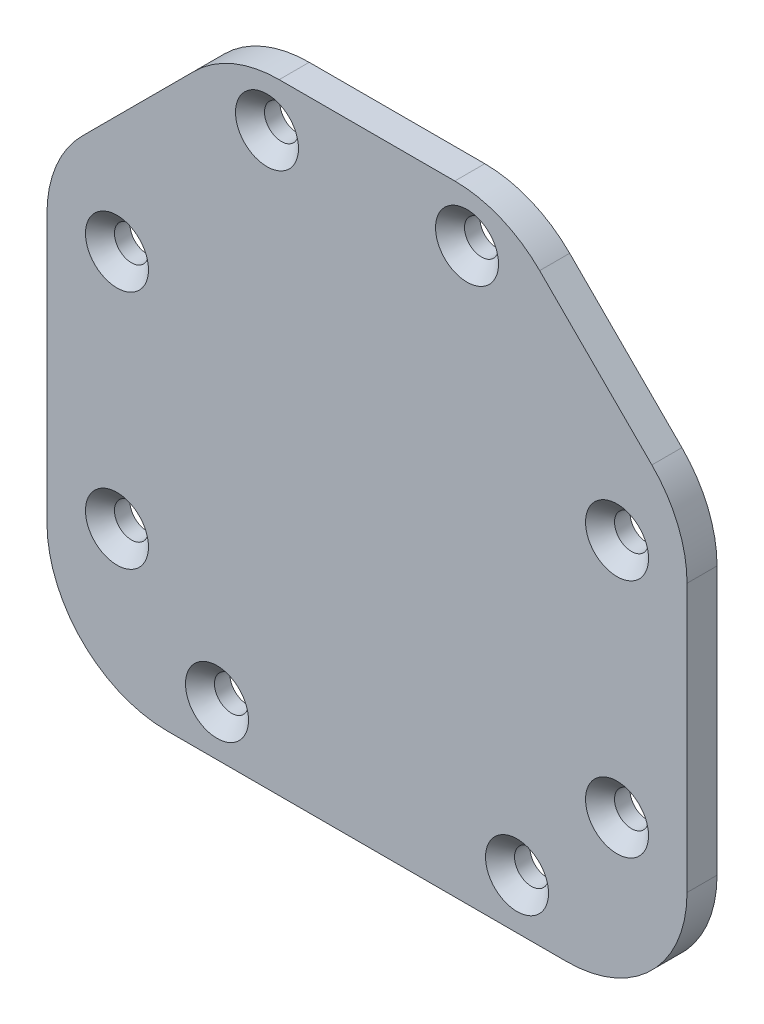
ISO-10303-21;
HEADER;
FILE_DESCRIPTION(('STEP AP214'),'2;1');
FILE_NAME('part.step','',(''),(''),'','','');
FILE_SCHEMA(('AUTOMOTIVE_DESIGN { 1 0 10303 214 1 1 1 1 }'));
ENDSEC;
DATA;
#1=APPLICATION_CONTEXT('core data for automotive mechanical design processes');
#2=APPLICATION_PROTOCOL_DEFINITION('international standard','automotive_design',2000,#1);
#3=PRODUCT_CONTEXT('',#1,'mechanical');
#4=PRODUCT('Part','Part','',(#3));
#5=PRODUCT_RELATED_PRODUCT_CATEGORY('part','',(#4));
#6=PRODUCT_DEFINITION_FORMATION('','',#4);
#7=PRODUCT_DEFINITION_CONTEXT('part definition',#1,'design');
#8=PRODUCT_DEFINITION('design','',#6,#7);
#9=PRODUCT_DEFINITION_SHAPE('','',#8);
#10=(LENGTH_UNIT() NAMED_UNIT(*) SI_UNIT(.MILLI.,.METRE.));
#11=(NAMED_UNIT(*) PLANE_ANGLE_UNIT() SI_UNIT($,.RADIAN.));
#12=(NAMED_UNIT(*) SI_UNIT($,.STERADIAN.) SOLID_ANGLE_UNIT());
#13=UNCERTAINTY_MEASURE_WITH_UNIT(LENGTH_MEASURE(1.E-05),#10,'distance_accuracy_value','');
#14=(GEOMETRIC_REPRESENTATION_CONTEXT(3) GLOBAL_UNCERTAINTY_ASSIGNED_CONTEXT((#13)) GLOBAL_UNIT_ASSIGNED_CONTEXT((#10,
#11,#12)) REPRESENTATION_CONTEXT('',''));
#15=CARTESIAN_POINT('',(0.,0.,0.));
#16=DIRECTION('',(0.,0.,1.));
#17=DIRECTION('',(1.,0.,0.));
#18=AXIS2_PLACEMENT_3D('',#15,#16,#17);
#19=CARTESIAN_POINT('',(20.,9.7794372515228,3.));
#20=DIRECTION('',(0.,0.,-1.));
#21=DIRECTION('',(-1.,0.,0.));
#22=AXIS2_PLACEMENT_3D('',#19,#20,#21);
#23=CYLINDRICAL_SURFACE('',#22,12.);
#24=CARTESIAN_POINT('',(20.,9.7794372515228,0.));
#25=DIRECTION('',(0.,0.,1.));
#26=DIRECTION('',(1.,0.,0.));
#27=AXIS2_PLACEMENT_3D('',#24,#25,#26);
#28=CIRCLE('',#27,12.);
#29=CARTESIAN_POINT('',(32.,9.77943725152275,0.));
#30=VERTEX_POINT('',#29);
#31=CARTESIAN_POINT('',(28.4852813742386,18.2647186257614,0.));
#32=VERTEX_POINT('',#31);
#33=EDGE_CURVE('E123',#30,#32,#28,.T.);
#34=ORIENTED_EDGE('',*,*,#33,.T.);
#35=DIRECTION('',(0.,0.,-1.));
#36=VECTOR('',#35,1.);
#37=CARTESIAN_POINT('',(28.4852813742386,18.2647186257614,3.));
#38=LINE('',#37,#36);
#39=CARTESIAN_POINT('',(28.4852813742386,18.2647186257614,3.));
#40=VERTEX_POINT('',#39);
#41=EDGE_CURVE('E11',#40,#32,#38,.T.);
#42=ORIENTED_EDGE('',*,*,#41,.F.);
#43=CARTESIAN_POINT('',(20.,9.7794372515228,3.));
#44=DIRECTION('',(0.,0.,1.));
#45=DIRECTION('',(1.,0.,0.));
#46=AXIS2_PLACEMENT_3D('',#43,#44,#45);
#47=CIRCLE('',#46,12.);
#48=CARTESIAN_POINT('',(32.,9.77943725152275,3.));
#49=VERTEX_POINT('',#48);
#50=EDGE_CURVE('E163',#49,#40,#47,.T.);
#51=ORIENTED_EDGE('',*,*,#50,.F.);
#52=DIRECTION('',(0.,0.,-1.));
#53=VECTOR('',#52,1.);
#54=CARTESIAN_POINT('',(32.,9.77943725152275,3.));
#55=LINE('',#54,#53);
#56=EDGE_CURVE('E136',#49,#30,#55,.T.);
#57=ORIENTED_EDGE('',*,*,#56,.T.);
#58=EDGE_LOOP('',(#34,#42,#51,#57));
#59=FACE_BOUND('',#58,.T.);
#60=ADVANCED_FACE('F31',(#59),#23,.T.);
#61=CARTESIAN_POINT('',(28.4852813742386,18.2647186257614,3.));
#62=DIRECTION('',(-0.707106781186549,-0.707106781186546,0.));
#63=DIRECTION('',(0.707106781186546,-0.707106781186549,0.));
#64=AXIS2_PLACEMENT_3D('',#61,#62,#63);
#65=PLANE('',#64);
#66=DIRECTION('',(-0.707106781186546,0.707106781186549,0.));
#67=VECTOR('',#66,1.);
#68=CARTESIAN_POINT('',(28.4852813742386,18.2647186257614,0.));
#69=LINE('',#68,#67);
#70=CARTESIAN_POINT('',(17.2647186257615,29.4852813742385,0.));
#71=VERTEX_POINT('',#70);
#72=EDGE_CURVE('E119',#32,#71,#69,.T.);
#73=ORIENTED_EDGE('',*,*,#72,.T.);
#74=DIRECTION('',(0.,0.,-1.));
#75=VECTOR('',#74,1.);
#76=CARTESIAN_POINT('',(17.2647186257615,29.4852813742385,3.));
#77=LINE('',#76,#75);
#78=CARTESIAN_POINT('',(17.2647186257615,29.4852813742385,3.));
#79=VERTEX_POINT('',#78);
#80=EDGE_CURVE('E38',#79,#71,#77,.T.);
#81=ORIENTED_EDGE('',*,*,#80,.F.);
#82=DIRECTION('',(-0.707106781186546,0.707106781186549,0.));
#83=VECTOR('',#82,1.);
#84=CARTESIAN_POINT('',(28.4852813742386,18.2647186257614,3.));
#85=LINE('',#84,#83);
#86=EDGE_CURVE('E132',#40,#79,#85,.T.);
#87=ORIENTED_EDGE('',*,*,#86,.F.);
#88=ORIENTED_EDGE('',*,*,#41,.T.);
#89=EDGE_LOOP('',(#73,#81,#87,#88));
#90=FACE_BOUND('',#89,.T.);
#91=ADVANCED_FACE('F131',(#90),#65,.F.);
#92=CARTESIAN_POINT('',(8.77943725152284,21.,3.));
#93=DIRECTION('',(0.,0.,-1.));
#94=DIRECTION('',(-1.,0.,0.));
#95=AXIS2_PLACEMENT_3D('',#92,#93,#94);
#96=CYLINDRICAL_SURFACE('',#95,12.);
#97=CARTESIAN_POINT('',(8.77943725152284,21.,0.));
#98=DIRECTION('',(0.,0.,1.));
#99=DIRECTION('',(1.,0.,0.));
#100=AXIS2_PLACEMENT_3D('',#97,#98,#99);
#101=CIRCLE('',#100,12.);
#102=CARTESIAN_POINT('',(8.7794372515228,33.,0.));
#103=VERTEX_POINT('',#102);
#104=EDGE_CURVE('E125',#71,#103,#101,.T.);
#105=ORIENTED_EDGE('',*,*,#104,.T.);
#106=DIRECTION('',(0.,0.,-1.));
#107=VECTOR('',#106,1.);
#108=CARTESIAN_POINT('',(8.7794372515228,33.,3.));
#109=LINE('',#108,#107);
#110=CARTESIAN_POINT('',(8.7794372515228,33.,3.));
#111=VERTEX_POINT('',#110);
#112=EDGE_CURVE('E209',#111,#103,#109,.T.);
#113=ORIENTED_EDGE('',*,*,#112,.F.);
#114=CARTESIAN_POINT('',(8.77943725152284,21.,3.));
#115=DIRECTION('',(0.,0.,1.));
#116=DIRECTION('',(1.,0.,0.));
#117=AXIS2_PLACEMENT_3D('',#114,#115,#116);
#118=CIRCLE('',#117,12.);
#119=EDGE_CURVE('E166',#79,#111,#118,.T.);
#120=ORIENTED_EDGE('',*,*,#119,.F.);
#121=ORIENTED_EDGE('',*,*,#80,.T.);
#122=EDGE_LOOP('',(#105,#113,#120,#121));
#123=FACE_BOUND('',#122,.T.);
#124=ADVANCED_FACE('F213',(#123),#96,.T.);
#125=CARTESIAN_POINT('',(8.7794372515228,33.,3.));
#126=DIRECTION('',(0.,-1.,0.));
#127=DIRECTION('',(0.,0.,-1.));
#128=AXIS2_PLACEMENT_3D('',#125,#126,#127);
#129=PLANE('',#128);
#130=DIRECTION('',(-1.,0.,0.));
#131=VECTOR('',#130,1.);
#132=CARTESIAN_POINT('',(8.7794372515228,33.,0.));
#133=LINE('',#132,#131);
#134=CARTESIAN_POINT('',(-8.7794372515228,33.,0.));
#135=VERTEX_POINT('',#134);
#136=EDGE_CURVE('E145',#103,#135,#133,.T.);
#137=ORIENTED_EDGE('',*,*,#136,.T.);
#138=DIRECTION('',(0.,0.,-1.));
#139=VECTOR('',#138,1.);
#140=CARTESIAN_POINT('',(-8.7794372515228,33.,3.));
#141=LINE('',#140,#139);
#142=CARTESIAN_POINT('',(-8.7794372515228,33.,3.));
#143=VERTEX_POINT('',#142);
#144=EDGE_CURVE('E206',#143,#135,#141,.T.);
#145=ORIENTED_EDGE('',*,*,#144,.F.);
#146=DIRECTION('',(-1.,0.,0.));
#147=VECTOR('',#146,1.);
#148=CARTESIAN_POINT('',(8.7794372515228,33.,3.));
#149=LINE('',#148,#147);
#150=EDGE_CURVE('E168',#111,#143,#149,.T.);
#151=ORIENTED_EDGE('',*,*,#150,.F.);
#152=ORIENTED_EDGE('',*,*,#112,.T.);
#153=EDGE_LOOP('',(#137,#145,#151,#152));
#154=FACE_BOUND('',#153,.T.);
#155=ADVANCED_FACE('F221',(#154),#129,.F.);
#156=CARTESIAN_POINT('',(-8.77943725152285,21.,3.));
#157=DIRECTION('',(0.,0.,-1.));
#158=DIRECTION('',(-1.,0.,0.));
#159=AXIS2_PLACEMENT_3D('',#156,#157,#158);
#160=CYLINDRICAL_SURFACE('',#159,12.);
#161=CARTESIAN_POINT('',(-8.77943725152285,21.,0.));
#162=DIRECTION('',(0.,0.,1.));
#163=DIRECTION('',(1.,0.,0.));
#164=AXIS2_PLACEMENT_3D('',#161,#162,#163);
#165=CIRCLE('',#164,12.);
#166=CARTESIAN_POINT('',(-17.2647186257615,29.4852813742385,0.));
#167=VERTEX_POINT('',#166);
#168=EDGE_CURVE('E147',#135,#167,#165,.T.);
#169=ORIENTED_EDGE('',*,*,#168,.T.);
#170=DIRECTION('',(0.,0.,-1.));
#171=VECTOR('',#170,1.);
#172=CARTESIAN_POINT('',(-17.2647186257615,29.4852813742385,3.));
#173=LINE('',#172,#171);
#174=CARTESIAN_POINT('',(-17.2647186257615,29.4852813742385,3.));
#175=VERTEX_POINT('',#174);
#176=EDGE_CURVE('E203',#175,#167,#173,.T.);
#177=ORIENTED_EDGE('',*,*,#176,.F.);
#178=CARTESIAN_POINT('',(-8.77943725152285,21.,3.));
#179=DIRECTION('',(0.,0.,1.));
#180=DIRECTION('',(1.,0.,0.));
#181=AXIS2_PLACEMENT_3D('',#178,#179,#180);
#182=CIRCLE('',#181,12.);
#183=EDGE_CURVE('E170',#143,#175,#182,.T.);
#184=ORIENTED_EDGE('',*,*,#183,.F.);
#185=ORIENTED_EDGE('',*,*,#144,.T.);
#186=EDGE_LOOP('',(#169,#177,#184,#185));
#187=FACE_BOUND('',#186,.T.);
#188=ADVANCED_FACE('F224',(#187),#160,.T.);
#189=CARTESIAN_POINT('',(-17.2647186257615,29.4852813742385,3.));
#190=DIRECTION('',(0.707106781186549,-0.707106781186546,0.));
#191=DIRECTION('',(0.707106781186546,0.707106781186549,0.));
#192=AXIS2_PLACEMENT_3D('',#189,#190,#191);
#193=PLANE('',#192);
#194=DIRECTION('',(-0.707106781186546,-0.707106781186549,0.));
#195=VECTOR('',#194,1.);
#196=CARTESIAN_POINT('',(-17.2647186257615,29.4852813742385,0.));
#197=LINE('',#196,#195);
#198=CARTESIAN_POINT('',(-28.4852813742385,18.2647186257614,0.));
#199=VERTEX_POINT('',#198);
#200=EDGE_CURVE('E149',#167,#199,#197,.T.);
#201=ORIENTED_EDGE('',*,*,#200,.T.);
#202=DIRECTION('',(0.,0.,-1.));
#203=VECTOR('',#202,1.);
#204=CARTESIAN_POINT('',(-28.4852813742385,18.2647186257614,3.));
#205=LINE('',#204,#203);
#206=CARTESIAN_POINT('',(-28.4852813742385,18.2647186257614,3.));
#207=VERTEX_POINT('',#206);
#208=EDGE_CURVE('E200',#207,#199,#205,.T.);
#209=ORIENTED_EDGE('',*,*,#208,.F.);
#210=DIRECTION('',(-0.707106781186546,-0.707106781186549,0.));
#211=VECTOR('',#210,1.);
#212=CARTESIAN_POINT('',(-17.2647186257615,29.4852813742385,3.));
#213=LINE('',#212,#211);
#214=EDGE_CURVE('E172',#175,#207,#213,.T.);
#215=ORIENTED_EDGE('',*,*,#214,.F.);
#216=ORIENTED_EDGE('',*,*,#176,.T.);
#217=EDGE_LOOP('',(#201,#209,#215,#216));
#218=FACE_BOUND('',#217,.T.);
#219=ADVANCED_FACE('F229',(#218),#193,.F.);
#220=CARTESIAN_POINT('',(-20.,9.77943725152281,3.));
#221=DIRECTION('',(0.,0.,-1.));
#222=DIRECTION('',(-1.,0.,0.));
#223=AXIS2_PLACEMENT_3D('',#220,#221,#222);
#224=CYLINDRICAL_SURFACE('',#223,12.);
#225=CARTESIAN_POINT('',(-20.,9.77943725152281,0.));
#226=DIRECTION('',(0.,0.,1.));
#227=DIRECTION('',(-1.,0.,0.));
#228=AXIS2_PLACEMENT_3D('',#225,#226,#227);
#229=CIRCLE('',#228,12.);
#230=CARTESIAN_POINT('',(-32.,9.77943725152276,0.));
#231=VERTEX_POINT('',#230);
#232=EDGE_CURVE('E151',#199,#231,#229,.T.);
#233=ORIENTED_EDGE('',*,*,#232,.T.);
#234=DIRECTION('',(0.,0.,-1.));
#235=VECTOR('',#234,1.);
#236=CARTESIAN_POINT('',(-32.,9.77943725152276,3.));
#237=LINE('',#236,#235);
#238=CARTESIAN_POINT('',(-32.,9.77943725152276,3.));
#239=VERTEX_POINT('',#238);
#240=EDGE_CURVE('E197',#239,#231,#237,.T.);
#241=ORIENTED_EDGE('',*,*,#240,.F.);
#242=CARTESIAN_POINT('',(-20.,9.77943725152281,3.));
#243=DIRECTION('',(0.,0.,1.));
#244=DIRECTION('',(-1.,0.,0.));
#245=AXIS2_PLACEMENT_3D('',#242,#243,#244);
#246=CIRCLE('',#245,12.);
#247=EDGE_CURVE('E174',#207,#239,#246,.T.);
#248=ORIENTED_EDGE('',*,*,#247,.F.);
#249=ORIENTED_EDGE('',*,*,#208,.T.);
#250=EDGE_LOOP('',(#233,#241,#248,#249));
#251=FACE_BOUND('',#250,.T.);
#252=ADVANCED_FACE('F235',(#251),#224,.T.);
#253=CARTESIAN_POINT('',(-32.,9.77943725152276,3.));
#254=DIRECTION('',(1.,0.,0.));
#255=DIRECTION('',(0.,1.,0.));
#256=AXIS2_PLACEMENT_3D('',#253,#254,#255);
#257=PLANE('',#256);
#258=DIRECTION('',(0.,-1.,0.));
#259=VECTOR('',#258,1.);
#260=CARTESIAN_POINT('',(-32.,9.77943725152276,0.));
#261=LINE('',#260,#259);
#262=CARTESIAN_POINT('',(-32.,-16.9999999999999,0.));
#263=VERTEX_POINT('',#262);
#264=EDGE_CURVE('E153',#231,#263,#261,.T.);
#265=ORIENTED_EDGE('',*,*,#264,.T.);
#266=DIRECTION('',(0.,0.,-1.));
#267=VECTOR('',#266,1.);
#268=CARTESIAN_POINT('',(-32.,-16.9999999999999,3.));
#269=LINE('',#268,#267);
#270=CARTESIAN_POINT('',(-32.,-16.9999999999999,3.));
#271=VERTEX_POINT('',#270);
#272=EDGE_CURVE('E194',#271,#263,#269,.T.);
#273=ORIENTED_EDGE('',*,*,#272,.F.);
#274=DIRECTION('',(0.,-1.,0.));
#275=VECTOR('',#274,1.);
#276=CARTESIAN_POINT('',(-32.,9.77943725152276,3.));
#277=LINE('',#276,#275);
#278=EDGE_CURVE('E176',#239,#271,#277,.T.);
#279=ORIENTED_EDGE('',*,*,#278,.F.);
#280=ORIENTED_EDGE('',*,*,#240,.T.);
#281=EDGE_LOOP('',(#265,#273,#279,#280));
#282=FACE_BOUND('',#281,.T.);
#283=ADVANCED_FACE('F239',(#282),#257,.F.);
#284=CARTESIAN_POINT('',(-20.,-17.,3.));
#285=DIRECTION('',(0.,0.,-1.));
#286=DIRECTION('',(-1.,0.,0.));
#287=AXIS2_PLACEMENT_3D('',#284,#285,#286);
#288=CYLINDRICAL_SURFACE('',#287,12.);
#289=CARTESIAN_POINT('',(-20.,-17.,0.));
#290=DIRECTION('',(0.,0.,1.));
#291=DIRECTION('',(1.,0.,0.));
#292=AXIS2_PLACEMENT_3D('',#289,#290,#291);
#293=CIRCLE('',#292,12.);
#294=CARTESIAN_POINT('',(-19.9999999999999,-29.,0.));
#295=VERTEX_POINT('',#294);
#296=EDGE_CURVE('E155',#263,#295,#293,.T.);
#297=ORIENTED_EDGE('',*,*,#296,.T.);
#298=DIRECTION('',(0.,0.,-1.));
#299=VECTOR('',#298,1.);
#300=CARTESIAN_POINT('',(-19.9999999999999,-29.,3.));
#301=LINE('',#300,#299);
#302=CARTESIAN_POINT('',(-19.9999999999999,-29.,3.));
#303=VERTEX_POINT('',#302);
#304=EDGE_CURVE('E191',#303,#295,#301,.T.);
#305=ORIENTED_EDGE('',*,*,#304,.F.);
#306=CARTESIAN_POINT('',(-20.,-17.,3.));
#307=DIRECTION('',(0.,0.,1.));
#308=DIRECTION('',(1.,0.,0.));
#309=AXIS2_PLACEMENT_3D('',#306,#307,#308);
#310=CIRCLE('',#309,12.);
#311=EDGE_CURVE('E178',#271,#303,#310,.T.);
#312=ORIENTED_EDGE('',*,*,#311,.F.);
#313=ORIENTED_EDGE('',*,*,#272,.T.);
#314=EDGE_LOOP('',(#297,#305,#312,#313));
#315=FACE_BOUND('',#314,.T.);
#316=ADVANCED_FACE('F244',(#315),#288,.T.);
#317=CARTESIAN_POINT('',(-19.9999999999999,-29.,3.));
#318=DIRECTION('',(0.,1.,0.));
#319=DIRECTION('',(0.,0.,1.));
#320=AXIS2_PLACEMENT_3D('',#317,#318,#319);
#321=PLANE('',#320);
#322=DIRECTION('',(1.,0.,0.));
#323=VECTOR('',#322,1.);
#324=CARTESIAN_POINT('',(-19.9999999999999,-29.,0.));
#325=LINE('',#324,#323);
#326=CARTESIAN_POINT('',(19.9999999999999,-29.,0.));
#327=VERTEX_POINT('',#326);
#328=EDGE_CURVE('E157',#295,#327,#325,.T.);
#329=ORIENTED_EDGE('',*,*,#328,.T.);
#330=DIRECTION('',(0.,0.,-1.));
#331=VECTOR('',#330,1.);
#332=CARTESIAN_POINT('',(19.9999999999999,-29.,3.));
#333=LINE('',#332,#331);
#334=CARTESIAN_POINT('',(19.9999999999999,-29.,3.));
#335=VERTEX_POINT('',#334);
#336=EDGE_CURVE('E188',#335,#327,#333,.T.);
#337=ORIENTED_EDGE('',*,*,#336,.F.);
#338=DIRECTION('',(1.,0.,0.));
#339=VECTOR('',#338,1.);
#340=CARTESIAN_POINT('',(-19.9999999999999,-29.,3.));
#341=LINE('',#340,#339);
#342=EDGE_CURVE('E180',#303,#335,#341,.T.);
#343=ORIENTED_EDGE('',*,*,#342,.F.);
#344=ORIENTED_EDGE('',*,*,#304,.T.);
#345=EDGE_LOOP('',(#329,#337,#343,#344));
#346=FACE_BOUND('',#345,.T.);
#347=ADVANCED_FACE('F248',(#346),#321,.F.);
#348=CARTESIAN_POINT('',(20.,-17.,3.));
#349=DIRECTION('',(0.,0.,-1.));
#350=DIRECTION('',(-1.,0.,0.));
#351=AXIS2_PLACEMENT_3D('',#348,#349,#350);
#352=CYLINDRICAL_SURFACE('',#351,12.);
#353=CARTESIAN_POINT('',(20.,-17.,0.));
#354=DIRECTION('',(0.,0.,1.));
#355=DIRECTION('',(1.,0.,0.));
#356=AXIS2_PLACEMENT_3D('',#353,#354,#355);
#357=CIRCLE('',#356,12.);
#358=CARTESIAN_POINT('',(32.,-16.9999999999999,0.));
#359=VERTEX_POINT('',#358);
#360=EDGE_CURVE('E159',#327,#359,#357,.T.);
#361=ORIENTED_EDGE('',*,*,#360,.T.);
#362=DIRECTION('',(0.,0.,-1.));
#363=VECTOR('',#362,1.);
#364=CARTESIAN_POINT('',(32.,-16.9999999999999,3.));
#365=LINE('',#364,#363);
#366=CARTESIAN_POINT('',(32.,-16.9999999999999,3.));
#367=VERTEX_POINT('',#366);
#368=EDGE_CURVE('E185',#367,#359,#365,.T.);
#369=ORIENTED_EDGE('',*,*,#368,.F.);
#370=CARTESIAN_POINT('',(20.,-17.,3.));
#371=DIRECTION('',(0.,0.,1.));
#372=DIRECTION('',(1.,0.,0.));
#373=AXIS2_PLACEMENT_3D('',#370,#371,#372);
#374=CIRCLE('',#373,12.);
#375=EDGE_CURVE('E50',#335,#367,#374,.T.);
#376=ORIENTED_EDGE('',*,*,#375,.F.);
#377=ORIENTED_EDGE('',*,*,#336,.T.);
#378=EDGE_LOOP('',(#361,#369,#376,#377));
#379=FACE_BOUND('',#378,.T.);
#380=ADVANCED_FACE('F252',(#379),#352,.T.);
#381=CARTESIAN_POINT('',(32.,-16.9999999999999,3.));
#382=DIRECTION('',(-1.,0.,0.));
#383=DIRECTION('',(0.,0.,1.));
#384=AXIS2_PLACEMENT_3D('',#381,#382,#383);
#385=PLANE('',#384);
#386=DIRECTION('',(0.,1.,0.));
#387=VECTOR('',#386,1.);
#388=CARTESIAN_POINT('',(32.,-16.9999999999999,0.));
#389=LINE('',#388,#387);
#390=EDGE_CURVE('E161',#359,#30,#389,.T.);
#391=ORIENTED_EDGE('',*,*,#390,.T.);
#392=ORIENTED_EDGE('',*,*,#56,.F.);
#393=DIRECTION('',(0.,1.,0.));
#394=VECTOR('',#393,1.);
#395=CARTESIAN_POINT('',(32.,-16.9999999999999,3.));
#396=LINE('',#395,#394);
#397=EDGE_CURVE('E45',#367,#49,#396,.T.);
#398=ORIENTED_EDGE('',*,*,#397,.F.);
#399=ORIENTED_EDGE('',*,*,#368,.T.);
#400=EDGE_LOOP('',(#391,#392,#398,#399));
#401=FACE_BOUND('',#400,.T.);
#402=ADVANCED_FACE('F254',(#401),#385,.F.);
#403=CARTESIAN_POINT('',(20.,9.7794372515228,3.));
#404=DIRECTION('',(0.,0.,1.));
#405=DIRECTION('',(1.,0.,0.));
#406=AXIS2_PLACEMENT_3D('',#403,#404,#405);
#407=PLANE('',#406);
#408=CARTESIAN_POINT('',(10.,28.,3.));
#409=DIRECTION('',(0.,0.,1.));
#410=DIRECTION('',(1.,0.,0.));
#411=AXIS2_PLACEMENT_3D('',#408,#409,#410);
#412=CIRCLE('',#411,3.15);
#413=CARTESIAN_POINT('',(13.15,28.,3.));
#414=VERTEX_POINT('',#413);
#415=EDGE_CURVE('E484',#414,#414,#412,.T.);
#416=ORIENTED_EDGE('',*,*,#415,.F.);
#417=EDGE_LOOP('',(#416));
#418=FACE_BOUND('',#417,.T.);
#419=CARTESIAN_POINT('',(-10.,28.,3.));
#420=DIRECTION('',(0.,0.,1.));
#421=DIRECTION('',(1.,0.,0.));
#422=AXIS2_PLACEMENT_3D('',#419,#420,#421);
#423=CIRCLE('',#422,3.15);
#424=CARTESIAN_POINT('',(-6.85,28.,3.));
#425=VERTEX_POINT('',#424);
#426=EDGE_CURVE('E496',#425,#425,#423,.T.);
#427=ORIENTED_EDGE('',*,*,#426,.F.);
#428=EDGE_LOOP('',(#427));
#429=FACE_BOUND('',#428,.T.);
#430=CARTESIAN_POINT('',(-25.,10.,3.));
#431=DIRECTION('',(0.,0.,1.));
#432=DIRECTION('',(1.,0.,0.));
#433=AXIS2_PLACEMENT_3D('',#430,#431,#432);
#434=CIRCLE('',#433,3.15);
#435=CARTESIAN_POINT('',(-21.85,10.,3.));
#436=VERTEX_POINT('',#435);
#437=EDGE_CURVE('E505',#436,#436,#434,.T.);
#438=ORIENTED_EDGE('',*,*,#437,.F.);
#439=EDGE_LOOP('',(#438));
#440=FACE_BOUND('',#439,.T.);
#441=CARTESIAN_POINT('',(-25.,-14.,3.));
#442=DIRECTION('',(0.,0.,1.));
#443=DIRECTION('',(1.,0.,0.));
#444=AXIS2_PLACEMENT_3D('',#441,#442,#443);
#445=CIRCLE('',#444,3.15);
#446=CARTESIAN_POINT('',(-21.85,-14.,3.));
#447=VERTEX_POINT('',#446);
#448=EDGE_CURVE('E514',#447,#447,#445,.T.);
#449=ORIENTED_EDGE('',*,*,#448,.F.);
#450=EDGE_LOOP('',(#449));
#451=FACE_BOUND('',#450,.T.);
#452=CARTESIAN_POINT('',(-15.,-24.,3.));
#453=DIRECTION('',(0.,0.,1.));
#454=DIRECTION('',(1.,0.,0.));
#455=AXIS2_PLACEMENT_3D('',#452,#453,#454);
#456=CIRCLE('',#455,3.15);
#457=CARTESIAN_POINT('',(-11.85,-24.,3.));
#458=VERTEX_POINT('',#457);
#459=EDGE_CURVE('E523',#458,#458,#456,.T.);
#460=ORIENTED_EDGE('',*,*,#459,.F.);
#461=EDGE_LOOP('',(#460));
#462=FACE_BOUND('',#461,.T.);
#463=CARTESIAN_POINT('',(15.,-24.,3.));
#464=DIRECTION('',(0.,0.,1.));
#465=DIRECTION('',(1.,0.,0.));
#466=AXIS2_PLACEMENT_3D('',#463,#464,#465);
#467=CIRCLE('',#466,3.15);
#468=CARTESIAN_POINT('',(18.15,-24.,3.));
#469=VERTEX_POINT('',#468);
#470=EDGE_CURVE('E532',#469,#469,#467,.T.);
#471=ORIENTED_EDGE('',*,*,#470,.F.);
#472=EDGE_LOOP('',(#471));
#473=FACE_BOUND('',#472,.T.);
#474=CARTESIAN_POINT('',(25.,-14.,3.));
#475=DIRECTION('',(0.,0.,1.));
#476=DIRECTION('',(1.,0.,0.));
#477=AXIS2_PLACEMENT_3D('',#474,#475,#476);
#478=CIRCLE('',#477,3.15);
#479=CARTESIAN_POINT('',(28.15,-14.,3.));
#480=VERTEX_POINT('',#479);
#481=EDGE_CURVE('E541',#480,#480,#478,.T.);
#482=ORIENTED_EDGE('',*,*,#481,.F.);
#483=EDGE_LOOP('',(#482));
#484=FACE_BOUND('',#483,.T.);
#485=CARTESIAN_POINT('',(25.,10.,3.));
#486=DIRECTION('',(0.,0.,1.));
#487=DIRECTION('',(1.,0.,0.));
#488=AXIS2_PLACEMENT_3D('',#485,#486,#487);
#489=CIRCLE('',#488,3.15);
#490=CARTESIAN_POINT('',(28.15,10.,3.));
#491=VERTEX_POINT('',#490);
#492=EDGE_CURVE('E137',#491,#491,#489,.T.);
#493=ORIENTED_EDGE('',*,*,#492,.F.);
#494=EDGE_LOOP('',(#493));
#495=FACE_BOUND('',#494,.T.);
#496=ORIENTED_EDGE('',*,*,#50,.T.);
#497=ORIENTED_EDGE('',*,*,#86,.T.);
#498=ORIENTED_EDGE('',*,*,#119,.T.);
#499=ORIENTED_EDGE('',*,*,#150,.T.);
#500=ORIENTED_EDGE('',*,*,#183,.T.);
#501=ORIENTED_EDGE('',*,*,#214,.T.);
#502=ORIENTED_EDGE('',*,*,#247,.T.);
#503=ORIENTED_EDGE('',*,*,#278,.T.);
#504=ORIENTED_EDGE('',*,*,#311,.T.);
#505=ORIENTED_EDGE('',*,*,#342,.T.);
#506=ORIENTED_EDGE('',*,*,#375,.T.);
#507=ORIENTED_EDGE('',*,*,#397,.T.);
#508=EDGE_LOOP('',(#496,#497,#498,#499,#500,#501,#502,#503,#504,#505,#506,#507));
#509=FACE_BOUND('',#508,.T.);
#510=ADVANCED_FACE('F216',(#418,#429,#440,#451,#462,#473,#484,#495,#509),#407,.T.);
#511=CARTESIAN_POINT('',(20.,9.7794372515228,0.));
#512=DIRECTION('',(0.,0.,1.));
#513=DIRECTION('',(1.,0.,0.));
#514=AXIS2_PLACEMENT_3D('',#511,#512,#513);
#515=PLANE('',#514);
#516=CARTESIAN_POINT('',(10.,28.,0.));
#517=DIRECTION('',(0.,0.,1.));
#518=DIRECTION('',(1.,0.,0.));
#519=AXIS2_PLACEMENT_3D('',#516,#517,#518);
#520=CIRCLE('',#519,1.7);
#521=CARTESIAN_POINT('',(11.7,28.,0.));
#522=VERTEX_POINT('',#521);
#523=EDGE_CURVE('E480',#522,#522,#520,.T.);
#524=ORIENTED_EDGE('',*,*,#523,.T.);
#525=EDGE_LOOP('',(#524));
#526=FACE_BOUND('',#525,.T.);
#527=CARTESIAN_POINT('',(-10.,28.,0.));
#528=DIRECTION('',(0.,0.,1.));
#529=DIRECTION('',(1.,0.,0.));
#530=AXIS2_PLACEMENT_3D('',#527,#528,#529);
#531=CIRCLE('',#530,1.7);
#532=CARTESIAN_POINT('',(-8.3,28.,0.));
#533=VERTEX_POINT('',#532);
#534=EDGE_CURVE('E487',#533,#533,#531,.T.);
#535=ORIENTED_EDGE('',*,*,#534,.T.);
#536=EDGE_LOOP('',(#535));
#537=FACE_BOUND('',#536,.T.);
#538=CARTESIAN_POINT('',(-25.,10.,0.));
#539=DIRECTION('',(0.,0.,1.));
#540=DIRECTION('',(1.,0.,0.));
#541=AXIS2_PLACEMENT_3D('',#538,#539,#540);
#542=CIRCLE('',#541,1.7);
#543=CARTESIAN_POINT('',(-23.3,10.,0.));
#544=VERTEX_POINT('',#543);
#545=EDGE_CURVE('E499',#544,#544,#542,.T.);
#546=ORIENTED_EDGE('',*,*,#545,.T.);
#547=EDGE_LOOP('',(#546));
#548=FACE_BOUND('',#547,.T.);
#549=CARTESIAN_POINT('',(-25.,-14.,0.));
#550=DIRECTION('',(0.,0.,1.));
#551=DIRECTION('',(1.,0.,0.));
#552=AXIS2_PLACEMENT_3D('',#549,#550,#551);
#553=CIRCLE('',#552,1.7);
#554=CARTESIAN_POINT('',(-23.3,-14.,0.));
#555=VERTEX_POINT('',#554);
#556=EDGE_CURVE('E508',#555,#555,#553,.T.);
#557=ORIENTED_EDGE('',*,*,#556,.T.);
#558=EDGE_LOOP('',(#557));
#559=FACE_BOUND('',#558,.T.);
#560=CARTESIAN_POINT('',(-15.,-24.,0.));
#561=DIRECTION('',(0.,0.,1.));
#562=DIRECTION('',(1.,0.,0.));
#563=AXIS2_PLACEMENT_3D('',#560,#561,#562);
#564=CIRCLE('',#563,1.7);
#565=CARTESIAN_POINT('',(-13.3,-24.,0.));
#566=VERTEX_POINT('',#565);
#567=EDGE_CURVE('E517',#566,#566,#564,.T.);
#568=ORIENTED_EDGE('',*,*,#567,.T.);
#569=EDGE_LOOP('',(#568));
#570=FACE_BOUND('',#569,.T.);
#571=CARTESIAN_POINT('',(15.,-24.,0.));
#572=DIRECTION('',(0.,0.,1.));
#573=DIRECTION('',(1.,0.,0.));
#574=AXIS2_PLACEMENT_3D('',#571,#572,#573);
#575=CIRCLE('',#574,1.7);
#576=CARTESIAN_POINT('',(16.7,-24.,0.));
#577=VERTEX_POINT('',#576);
#578=EDGE_CURVE('E526',#577,#577,#575,.T.);
#579=ORIENTED_EDGE('',*,*,#578,.T.);
#580=EDGE_LOOP('',(#579));
#581=FACE_BOUND('',#580,.T.);
#582=CARTESIAN_POINT('',(25.,-14.,0.));
#583=DIRECTION('',(0.,0.,1.));
#584=DIRECTION('',(1.,0.,0.));
#585=AXIS2_PLACEMENT_3D('',#582,#583,#584);
#586=CIRCLE('',#585,1.7);
#587=CARTESIAN_POINT('',(26.7,-14.,0.));
#588=VERTEX_POINT('',#587);
#589=EDGE_CURVE('E535',#588,#588,#586,.T.);
#590=ORIENTED_EDGE('',*,*,#589,.T.);
#591=EDGE_LOOP('',(#590));
#592=FACE_BOUND('',#591,.T.);
#593=CARTESIAN_POINT('',(25.,10.,0.));
#594=DIRECTION('',(0.,0.,1.));
#595=DIRECTION('',(1.,0.,0.));
#596=AXIS2_PLACEMENT_3D('',#593,#594,#595);
#597=CIRCLE('',#596,1.7);
#598=CARTESIAN_POINT('',(26.7,10.,0.));
#599=VERTEX_POINT('',#598);
#600=EDGE_CURVE('E544',#599,#599,#597,.T.);
#601=ORIENTED_EDGE('',*,*,#600,.T.);
#602=EDGE_LOOP('',(#601));
#603=FACE_BOUND('',#602,.T.);
#604=ORIENTED_EDGE('',*,*,#33,.F.);
#605=ORIENTED_EDGE('',*,*,#390,.F.);
#606=ORIENTED_EDGE('',*,*,#360,.F.);
#607=ORIENTED_EDGE('',*,*,#328,.F.);
#608=ORIENTED_EDGE('',*,*,#296,.F.);
#609=ORIENTED_EDGE('',*,*,#264,.F.);
#610=ORIENTED_EDGE('',*,*,#232,.F.);
#611=ORIENTED_EDGE('',*,*,#200,.F.);
#612=ORIENTED_EDGE('',*,*,#168,.F.);
#613=ORIENTED_EDGE('',*,*,#136,.F.);
#614=ORIENTED_EDGE('',*,*,#104,.F.);
#615=ORIENTED_EDGE('',*,*,#72,.F.);
#616=EDGE_LOOP('',(#604,#605,#606,#607,#608,#609,#610,#611,#612,#613,#614,#615));
#617=FACE_BOUND('',#616,.T.);
#618=ADVANCED_FACE('F120',(#526,#537,#548,#559,#570,#581,#592,#603,#617),#515,.F.);
#619=CARTESIAN_POINT('',(25.,10.,3.));
#620=DIRECTION('',(0.,0.,1.));
#621=DIRECTION('',(1.,0.,0.));
#622=AXIS2_PLACEMENT_3D('',#619,#620,#621);
#623=CONICAL_SURFACE('',#622,3.15,0.785398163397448);
#624=CARTESIAN_POINT('',(25.,10.,1.55));
#625=DIRECTION('',(0.,0.,1.));
#626=DIRECTION('',(1.,0.,0.));
#627=AXIS2_PLACEMENT_3D('',#624,#625,#626);
#628=CIRCLE('',#627,1.7);
#629=CARTESIAN_POINT('',(26.7,10.,1.55));
#630=VERTEX_POINT('',#629);
#631=EDGE_CURVE('E140',#630,#630,#628,.T.);
#632=ORIENTED_EDGE('',*,*,#631,.F.);
#633=EDGE_LOOP('',(#632));
#634=FACE_BOUND('',#633,.T.);
#635=ORIENTED_EDGE('',*,*,#492,.T.);
#636=EDGE_LOOP('',(#635));
#637=FACE_BOUND('',#636,.T.);
#638=ADVANCED_FACE('F313',(#634,#637),#623,.F.);
#639=CARTESIAN_POINT('',(25.,10.,3.));
#640=DIRECTION('',(0.,0.,1.));
#641=DIRECTION('',(1.,0.,0.));
#642=AXIS2_PLACEMENT_3D('',#639,#640,#641);
#643=CYLINDRICAL_SURFACE('',#642,1.7);
#644=ORIENTED_EDGE('',*,*,#600,.F.);
#645=EDGE_LOOP('',(#644));
#646=FACE_BOUND('',#645,.T.);
#647=ORIENTED_EDGE('',*,*,#631,.T.);
#648=EDGE_LOOP('',(#647));
#649=FACE_BOUND('',#648,.T.);
#650=ADVANCED_FACE('F323',(#646,#649),#643,.F.);
#651=CARTESIAN_POINT('',(25.,-14.,3.));
#652=DIRECTION('',(0.,0.,1.));
#653=DIRECTION('',(1.,0.,0.));
#654=AXIS2_PLACEMENT_3D('',#651,#652,#653);
#655=CONICAL_SURFACE('',#654,3.15,0.785398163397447);
#656=CARTESIAN_POINT('',(25.,-14.,1.55));
#657=DIRECTION('',(0.,0.,1.));
#658=DIRECTION('',(1.,0.,0.));
#659=AXIS2_PLACEMENT_3D('',#656,#657,#658);
#660=CIRCLE('',#659,1.7);
#661=CARTESIAN_POINT('',(26.7,-14.,1.55));
#662=VERTEX_POINT('',#661);
#663=EDGE_CURVE('E538',#662,#662,#660,.T.);
#664=ORIENTED_EDGE('',*,*,#663,.F.);
#665=EDGE_LOOP('',(#664));
#666=FACE_BOUND('',#665,.T.);
#667=ORIENTED_EDGE('',*,*,#481,.T.);
#668=EDGE_LOOP('',(#667));
#669=FACE_BOUND('',#668,.T.);
#670=ADVANCED_FACE('F333',(#666,#669),#655,.F.);
#671=CARTESIAN_POINT('',(25.,-14.,3.));
#672=DIRECTION('',(0.,0.,1.));
#673=DIRECTION('',(1.,0.,0.));
#674=AXIS2_PLACEMENT_3D('',#671,#672,#673);
#675=CYLINDRICAL_SURFACE('',#674,1.7);
#676=ORIENTED_EDGE('',*,*,#589,.F.);
#677=EDGE_LOOP('',(#676));
#678=FACE_BOUND('',#677,.T.);
#679=ORIENTED_EDGE('',*,*,#663,.T.);
#680=EDGE_LOOP('',(#679));
#681=FACE_BOUND('',#680,.T.);
#682=ADVANCED_FACE('F343',(#678,#681),#675,.F.);
#683=CARTESIAN_POINT('',(15.,-24.,3.));
#684=DIRECTION('',(0.,0.,1.));
#685=DIRECTION('',(1.,0.,0.));
#686=AXIS2_PLACEMENT_3D('',#683,#684,#685);
#687=CONICAL_SURFACE('',#686,3.15,0.785398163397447);
#688=CARTESIAN_POINT('',(15.,-24.,1.55));
#689=DIRECTION('',(0.,0.,1.));
#690=DIRECTION('',(1.,0.,0.));
#691=AXIS2_PLACEMENT_3D('',#688,#689,#690);
#692=CIRCLE('',#691,1.7);
#693=CARTESIAN_POINT('',(16.7,-24.,1.55));
#694=VERTEX_POINT('',#693);
#695=EDGE_CURVE('E529',#694,#694,#692,.T.);
#696=ORIENTED_EDGE('',*,*,#695,.F.);
#697=EDGE_LOOP('',(#696));
#698=FACE_BOUND('',#697,.T.);
#699=ORIENTED_EDGE('',*,*,#470,.T.);
#700=EDGE_LOOP('',(#699));
#701=FACE_BOUND('',#700,.T.);
#702=ADVANCED_FACE('F353',(#698,#701),#687,.F.);
#703=CARTESIAN_POINT('',(15.,-24.,3.));
#704=DIRECTION('',(0.,0.,1.));
#705=DIRECTION('',(1.,0.,0.));
#706=AXIS2_PLACEMENT_3D('',#703,#704,#705);
#707=CYLINDRICAL_SURFACE('',#706,1.7);
#708=ORIENTED_EDGE('',*,*,#578,.F.);
#709=EDGE_LOOP('',(#708));
#710=FACE_BOUND('',#709,.T.);
#711=ORIENTED_EDGE('',*,*,#695,.T.);
#712=EDGE_LOOP('',(#711));
#713=FACE_BOUND('',#712,.T.);
#714=ADVANCED_FACE('F363',(#710,#713),#707,.F.);
#715=CARTESIAN_POINT('',(-15.,-24.,3.));
#716=DIRECTION('',(0.,0.,1.));
#717=DIRECTION('',(1.,0.,0.));
#718=AXIS2_PLACEMENT_3D('',#715,#716,#717);
#719=CONICAL_SURFACE('',#718,3.15,0.785398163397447);
#720=CARTESIAN_POINT('',(-15.,-24.,1.55));
#721=DIRECTION('',(0.,0.,1.));
#722=DIRECTION('',(1.,0.,0.));
#723=AXIS2_PLACEMENT_3D('',#720,#721,#722);
#724=CIRCLE('',#723,1.7);
#725=CARTESIAN_POINT('',(-13.3,-24.,1.55));
#726=VERTEX_POINT('',#725);
#727=EDGE_CURVE('E520',#726,#726,#724,.T.);
#728=ORIENTED_EDGE('',*,*,#727,.F.);
#729=EDGE_LOOP('',(#728));
#730=FACE_BOUND('',#729,.T.);
#731=ORIENTED_EDGE('',*,*,#459,.T.);
#732=EDGE_LOOP('',(#731));
#733=FACE_BOUND('',#732,.T.);
#734=ADVANCED_FACE('F373',(#730,#733),#719,.F.);
#735=CARTESIAN_POINT('',(-15.,-24.,3.));
#736=DIRECTION('',(0.,0.,1.));
#737=DIRECTION('',(1.,0.,0.));
#738=AXIS2_PLACEMENT_3D('',#735,#736,#737);
#739=CYLINDRICAL_SURFACE('',#738,1.7);
#740=ORIENTED_EDGE('',*,*,#567,.F.);
#741=EDGE_LOOP('',(#740));
#742=FACE_BOUND('',#741,.T.);
#743=ORIENTED_EDGE('',*,*,#727,.T.);
#744=EDGE_LOOP('',(#743));
#745=FACE_BOUND('',#744,.T.);
#746=ADVANCED_FACE('F383',(#742,#745),#739,.F.);
#747=CARTESIAN_POINT('',(-25.,-14.,3.));
#748=DIRECTION('',(0.,0.,1.));
#749=DIRECTION('',(1.,0.,0.));
#750=AXIS2_PLACEMENT_3D('',#747,#748,#749);
#751=CONICAL_SURFACE('',#750,3.15,0.785398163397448);
#752=CARTESIAN_POINT('',(-25.,-14.,1.55));
#753=DIRECTION('',(0.,0.,1.));
#754=DIRECTION('',(1.,0.,0.));
#755=AXIS2_PLACEMENT_3D('',#752,#753,#754);
#756=CIRCLE('',#755,1.7);
#757=CARTESIAN_POINT('',(-23.3,-14.,1.55));
#758=VERTEX_POINT('',#757);
#759=EDGE_CURVE('E511',#758,#758,#756,.T.);
#760=ORIENTED_EDGE('',*,*,#759,.F.);
#761=EDGE_LOOP('',(#760));
#762=FACE_BOUND('',#761,.T.);
#763=ORIENTED_EDGE('',*,*,#448,.T.);
#764=EDGE_LOOP('',(#763));
#765=FACE_BOUND('',#764,.T.);
#766=ADVANCED_FACE('F393',(#762,#765),#751,.F.);
#767=CARTESIAN_POINT('',(-25.,-14.,3.));
#768=DIRECTION('',(0.,0.,1.));
#769=DIRECTION('',(1.,0.,0.));
#770=AXIS2_PLACEMENT_3D('',#767,#768,#769);
#771=CYLINDRICAL_SURFACE('',#770,1.7);
#772=ORIENTED_EDGE('',*,*,#556,.F.);
#773=EDGE_LOOP('',(#772));
#774=FACE_BOUND('',#773,.T.);
#775=ORIENTED_EDGE('',*,*,#759,.T.);
#776=EDGE_LOOP('',(#775));
#777=FACE_BOUND('',#776,.T.);
#778=ADVANCED_FACE('F403',(#774,#777),#771,.F.);
#779=CARTESIAN_POINT('',(-25.,10.,3.));
#780=DIRECTION('',(0.,0.,1.));
#781=DIRECTION('',(1.,0.,0.));
#782=AXIS2_PLACEMENT_3D('',#779,#780,#781);
#783=CONICAL_SURFACE('',#782,3.15,0.785398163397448);
#784=CARTESIAN_POINT('',(-25.,10.,1.55));
#785=DIRECTION('',(0.,0.,1.));
#786=DIRECTION('',(1.,0.,0.));
#787=AXIS2_PLACEMENT_3D('',#784,#785,#786);
#788=CIRCLE('',#787,1.7);
#789=CARTESIAN_POINT('',(-23.3,10.,1.55));
#790=VERTEX_POINT('',#789);
#791=EDGE_CURVE('E502',#790,#790,#788,.T.);
#792=ORIENTED_EDGE('',*,*,#791,.F.);
#793=EDGE_LOOP('',(#792));
#794=FACE_BOUND('',#793,.T.);
#795=ORIENTED_EDGE('',*,*,#437,.T.);
#796=EDGE_LOOP('',(#795));
#797=FACE_BOUND('',#796,.T.);
#798=ADVANCED_FACE('F413',(#794,#797),#783,.F.);
#799=CARTESIAN_POINT('',(-25.,10.,3.));
#800=DIRECTION('',(0.,0.,1.));
#801=DIRECTION('',(1.,0.,0.));
#802=AXIS2_PLACEMENT_3D('',#799,#800,#801);
#803=CYLINDRICAL_SURFACE('',#802,1.7);
#804=ORIENTED_EDGE('',*,*,#545,.F.);
#805=EDGE_LOOP('',(#804));
#806=FACE_BOUND('',#805,.T.);
#807=ORIENTED_EDGE('',*,*,#791,.T.);
#808=EDGE_LOOP('',(#807));
#809=FACE_BOUND('',#808,.T.);
#810=ADVANCED_FACE('F423',(#806,#809),#803,.F.);
#811=CARTESIAN_POINT('',(-10.,28.,3.));
#812=DIRECTION('',(0.,0.,1.));
#813=DIRECTION('',(1.,0.,0.));
#814=AXIS2_PLACEMENT_3D('',#811,#812,#813);
#815=CONICAL_SURFACE('',#814,3.15,0.785398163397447);
#816=CARTESIAN_POINT('',(-10.,28.,1.55));
#817=DIRECTION('',(0.,0.,1.));
#818=DIRECTION('',(1.,0.,0.));
#819=AXIS2_PLACEMENT_3D('',#816,#817,#818);
#820=CIRCLE('',#819,1.7);
#821=CARTESIAN_POINT('',(-8.3,28.,1.55));
#822=VERTEX_POINT('',#821);
#823=EDGE_CURVE('E493',#822,#822,#820,.T.);
#824=ORIENTED_EDGE('',*,*,#823,.F.);
#825=EDGE_LOOP('',(#824));
#826=FACE_BOUND('',#825,.T.);
#827=ORIENTED_EDGE('',*,*,#426,.T.);
#828=EDGE_LOOP('',(#827));
#829=FACE_BOUND('',#828,.T.);
#830=ADVANCED_FACE('F433',(#826,#829),#815,.F.);
#831=CARTESIAN_POINT('',(-10.,28.,3.));
#832=DIRECTION('',(0.,0.,1.));
#833=DIRECTION('',(1.,0.,0.));
#834=AXIS2_PLACEMENT_3D('',#831,#832,#833);
#835=CYLINDRICAL_SURFACE('',#834,1.7);
#836=ORIENTED_EDGE('',*,*,#534,.F.);
#837=EDGE_LOOP('',(#836));
#838=FACE_BOUND('',#837,.T.);
#839=ORIENTED_EDGE('',*,*,#823,.T.);
#840=EDGE_LOOP('',(#839));
#841=FACE_BOUND('',#840,.T.);
#842=ADVANCED_FACE('F443',(#838,#841),#835,.F.);
#843=CARTESIAN_POINT('',(10.,28.,3.));
#844=DIRECTION('',(0.,0.,1.));
#845=DIRECTION('',(1.,0.,0.));
#846=AXIS2_PLACEMENT_3D('',#843,#844,#845);
#847=CONICAL_SURFACE('',#846,3.15,0.785398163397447);
#848=CARTESIAN_POINT('',(10.,28.,1.55));
#849=DIRECTION('',(0.,0.,1.));
#850=DIRECTION('',(1.,0.,0.));
#851=AXIS2_PLACEMENT_3D('',#848,#849,#850);
#852=CIRCLE('',#851,1.7);
#853=CARTESIAN_POINT('',(11.7,28.,1.55));
#854=VERTEX_POINT('',#853);
#855=EDGE_CURVE('E483',#854,#854,#852,.T.);
#856=ORIENTED_EDGE('',*,*,#855,.F.);
#857=EDGE_LOOP('',(#856));
#858=FACE_BOUND('',#857,.T.);
#859=ORIENTED_EDGE('',*,*,#415,.T.);
#860=EDGE_LOOP('',(#859));
#861=FACE_BOUND('',#860,.T.);
#862=ADVANCED_FACE('F453',(#858,#861),#847,.F.);
#863=CARTESIAN_POINT('',(10.,28.,3.));
#864=DIRECTION('',(0.,0.,1.));
#865=DIRECTION('',(1.,0.,0.));
#866=AXIS2_PLACEMENT_3D('',#863,#864,#865);
#867=CYLINDRICAL_SURFACE('',#866,1.7);
#868=ORIENTED_EDGE('',*,*,#523,.F.);
#869=EDGE_LOOP('',(#868));
#870=FACE_BOUND('',#869,.T.);
#871=ORIENTED_EDGE('',*,*,#855,.T.);
#872=EDGE_LOOP('',(#871));
#873=FACE_BOUND('',#872,.T.);
#874=ADVANCED_FACE('F463',(#870,#873),#867,.F.);
#875=CLOSED_SHELL('',(#60,#91,#124,#155,#188,#219,#252,#283,#316,#347,#380,#402,#510,#618,#638,
#650,#670,#682,#702,#714,#734,#746,#766,#778,#798,#810,#830,#842,#862,#874));
#876=MANIFOLD_SOLID_BREP('B2',#875);
#877=ADVANCED_BREP_SHAPE_REPRESENTATION('',(#18,#876),#14);
#878=SHAPE_DEFINITION_REPRESENTATION(#9,#877);
ENDSEC;
END-ISO-10303-21;
